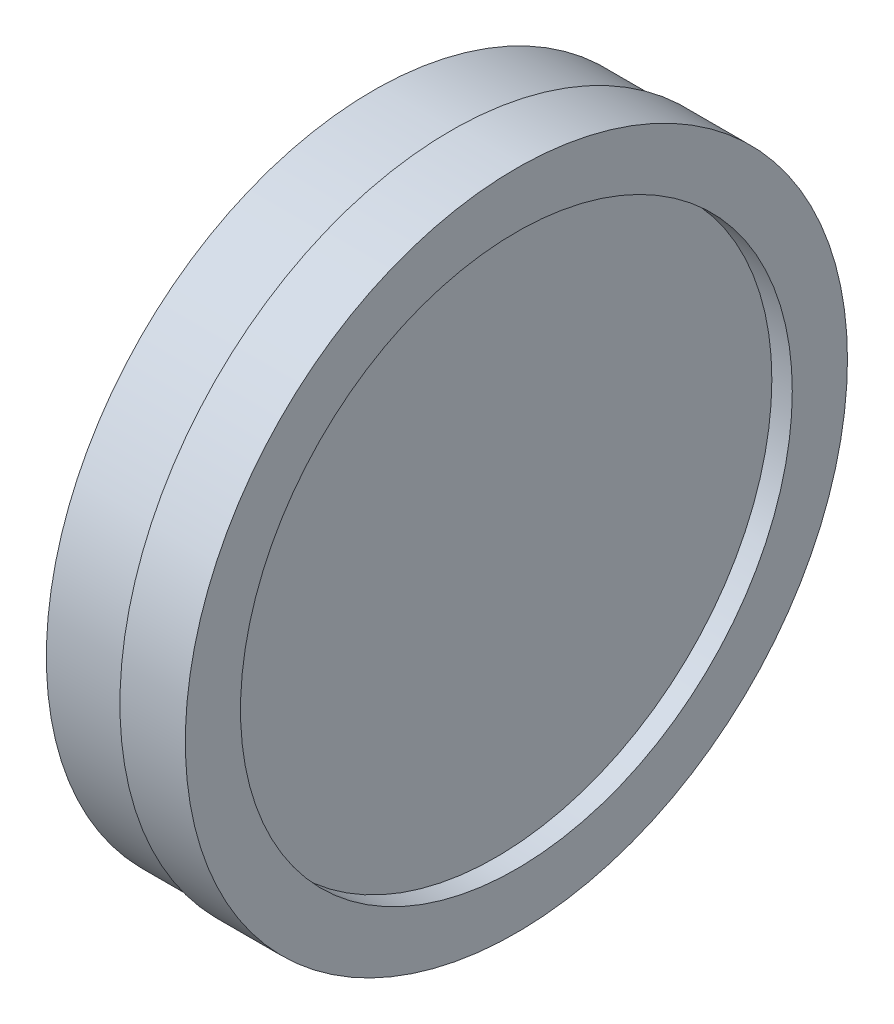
ISO-10303-21;
HEADER;
FILE_DESCRIPTION(('STEP AP214'),'2;1');
FILE_NAME('part.step','',(''),(''),'','','');
FILE_SCHEMA(('AUTOMOTIVE_DESIGN { 1 0 10303 214 1 1 1 1 }'));
ENDSEC;
DATA;
#1=APPLICATION_CONTEXT('core data for automotive mechanical design processes');
#2=APPLICATION_PROTOCOL_DEFINITION('international standard','automotive_design',2000,#1);
#3=PRODUCT_CONTEXT('',#1,'mechanical');
#4=PRODUCT('Part','Part','',(#3));
#5=PRODUCT_RELATED_PRODUCT_CATEGORY('part','',(#4));
#6=PRODUCT_DEFINITION_FORMATION('','',#4);
#7=PRODUCT_DEFINITION_CONTEXT('part definition',#1,'design');
#8=PRODUCT_DEFINITION('design','',#6,#7);
#9=PRODUCT_DEFINITION_SHAPE('','',#8);
#10=(LENGTH_UNIT() NAMED_UNIT(*) SI_UNIT(.MILLI.,.METRE.));
#11=(NAMED_UNIT(*) PLANE_ANGLE_UNIT() SI_UNIT($,.RADIAN.));
#12=(NAMED_UNIT(*) SI_UNIT($,.STERADIAN.) SOLID_ANGLE_UNIT());
#13=UNCERTAINTY_MEASURE_WITH_UNIT(LENGTH_MEASURE(1.E-05),#10,'distance_accuracy_value','');
#14=(GEOMETRIC_REPRESENTATION_CONTEXT(3) GLOBAL_UNCERTAINTY_ASSIGNED_CONTEXT((#13)) GLOBAL_UNIT_ASSIGNED_CONTEXT((#10,
#11,#12)) REPRESENTATION_CONTEXT('',''));
#15=CARTESIAN_POINT('',(0.,0.,0.));
#16=DIRECTION('',(0.,0.,1.));
#17=DIRECTION('',(1.,0.,0.));
#18=AXIS2_PLACEMENT_3D('',#15,#16,#17);
#19=CARTESIAN_POINT('',(0.,0.,0.));
#20=DIRECTION('',(1.,0.,0.));
#21=DIRECTION('',(0.,0.,-1.));
#22=AXIS2_PLACEMENT_3D('',#19,#20,#21);
#23=CYLINDRICAL_SURFACE('',#22,67.5);
#24=CARTESIAN_POINT('',(-5.,0.,0.));
#25=DIRECTION('',(1.,0.,0.));
#26=DIRECTION('',(0.,0.,-1.));
#27=AXIS2_PLACEMENT_3D('',#24,#25,#26);
#28=CIRCLE('',#27,67.5);
#29=CARTESIAN_POINT('',(-5.,0.,-67.5));
#30=VERTEX_POINT('',#29);
#31=EDGE_CURVE('E11',#30,#30,#28,.T.);
#32=ORIENTED_EDGE('',*,*,#31,.F.);
#33=EDGE_LOOP('',(#32));
#34=FACE_BOUND('',#33,.T.);
#35=CARTESIAN_POINT('',(0.,0.,0.));
#36=DIRECTION('',(1.,0.,0.));
#37=DIRECTION('',(0.,0.,-1.));
#38=AXIS2_PLACEMENT_3D('',#35,#36,#37);
#39=CIRCLE('',#38,67.5);
#40=CARTESIAN_POINT('',(0.,0.,-67.5));
#41=VERTEX_POINT('',#40);
#42=EDGE_CURVE('E129',#41,#41,#39,.T.);
#43=ORIENTED_EDGE('',*,*,#42,.T.);
#44=EDGE_LOOP('',(#43));
#45=FACE_BOUND('',#44,.T.);
#46=ADVANCED_FACE('F17',(#34,#45),#23,.F.);
#47=CARTESIAN_POINT('',(-26.5,40.,0.));
#48=DIRECTION('',(-1.,0.,0.));
#49=DIRECTION('',(0.,0.,1.));
#50=AXIS2_PLACEMENT_3D('',#47,#48,#49);
#51=PLANE('',#50);
#52=CARTESIAN_POINT('',(-26.5,0.,0.));
#53=DIRECTION('',(1.,0.,0.));
#54=DIRECTION('',(0.,0.,-1.));
#55=AXIS2_PLACEMENT_3D('',#52,#53,#54);
#56=CIRCLE('',#55,40.);
#57=CARTESIAN_POINT('',(-26.5,0.,-40.));
#58=VERTEX_POINT('',#57);
#59=EDGE_CURVE('E24',#58,#58,#56,.T.);
#60=ORIENTED_EDGE('',*,*,#59,.F.);
#61=EDGE_LOOP('',(#60));
#62=FACE_BOUND('',#61,.T.);
#63=ADVANCED_FACE('F152',(#62),#51,.T.);
#64=CARTESIAN_POINT('',(0.,0.,0.));
#65=DIRECTION('',(1.,0.,0.));
#66=DIRECTION('',(0.,0.,-1.));
#67=AXIS2_PLACEMENT_3D('',#64,#65,#66);
#68=CYLINDRICAL_SURFACE('',#67,40.);
#69=ORIENTED_EDGE('',*,*,#59,.T.);
#70=EDGE_LOOP('',(#69));
#71=FACE_BOUND('',#70,.T.);
#72=CARTESIAN_POINT('',(-35.,0.,0.));
#73=DIRECTION('',(1.,0.,0.));
#74=DIRECTION('',(0.,0.,-1.));
#75=AXIS2_PLACEMENT_3D('',#72,#73,#74);
#76=CIRCLE('',#75,40.);
#77=CARTESIAN_POINT('',(-35.,0.,-40.));
#78=VERTEX_POINT('',#77);
#79=EDGE_CURVE('E144',#78,#78,#76,.T.);
#80=ORIENTED_EDGE('',*,*,#79,.F.);
#81=EDGE_LOOP('',(#80));
#82=FACE_BOUND('',#81,.T.);
#83=ADVANCED_FACE('F149',(#71,#82),#68,.F.);
#84=CARTESIAN_POINT('',(-35.,80.,0.));
#85=DIRECTION('',(-1.,0.,0.));
#86=DIRECTION('',(0.,0.,1.));
#87=AXIS2_PLACEMENT_3D('',#84,#85,#86);
#88=PLANE('',#87);
#89=CARTESIAN_POINT('',(-35.,54.1265877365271,-31.2500000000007));
#90=DIRECTION('',(-1.,0.,0.));
#91=DIRECTION('',(0.,0.,1.));
#92=AXIS2_PLACEMENT_3D('',#89,#90,#91);
#93=CIRCLE('',#92,5.);
#94=CARTESIAN_POINT('',(-35.,54.1265877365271,-26.2500000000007));
#95=VERTEX_POINT('',#94);
#96=EDGE_CURVE('E212',#95,#95,#93,.T.);
#97=ORIENTED_EDGE('',*,*,#96,.F.);
#98=EDGE_LOOP('',(#97));
#99=FACE_BOUND('',#98,.T.);
#100=CARTESIAN_POINT('',(-35.,54.1265877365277,31.2499999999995));
#101=DIRECTION('',(-1.,0.,0.));
#102=DIRECTION('',(0.,0.,1.));
#103=AXIS2_PLACEMENT_3D('',#100,#101,#102);
#104=CIRCLE('',#103,5.);
#105=CARTESIAN_POINT('',(-35.,54.1265877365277,36.2499999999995));
#106=VERTEX_POINT('',#105);
#107=EDGE_CURVE('E56',#106,#106,#104,.T.);
#108=ORIENTED_EDGE('',*,*,#107,.F.);
#109=EDGE_LOOP('',(#108));
#110=FACE_BOUND('',#109,.T.);
#111=CARTESIAN_POINT('',(-35.,4.36435420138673E-13,62.5));
#112=DIRECTION('',(-1.,0.,0.));
#113=DIRECTION('',(0.,0.,1.));
#114=AXIS2_PLACEMENT_3D('',#111,#112,#113);
#115=CIRCLE('',#114,5.);
#116=CARTESIAN_POINT('',(-35.,4.36435420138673E-13,67.5));
#117=VERTEX_POINT('',#116);
#118=EDGE_CURVE('E75',#117,#117,#115,.T.);
#119=ORIENTED_EDGE('',*,*,#118,.F.);
#120=EDGE_LOOP('',(#119));
#121=FACE_BOUND('',#120,.T.);
#122=CARTESIAN_POINT('',(-35.,-54.1265877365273,31.25));
#123=DIRECTION('',(-1.,0.,0.));
#124=DIRECTION('',(0.,0.,1.));
#125=AXIS2_PLACEMENT_3D('',#122,#123,#124);
#126=CIRCLE('',#125,5.);
#127=CARTESIAN_POINT('',(-35.,-54.1265877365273,36.25));
#128=VERTEX_POINT('',#127);
#129=EDGE_CURVE('E87',#128,#128,#126,.T.);
#130=ORIENTED_EDGE('',*,*,#129,.F.);
#131=EDGE_LOOP('',(#130));
#132=FACE_BOUND('',#131,.T.);
#133=CARTESIAN_POINT('',(-35.,-54.1265877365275,-31.25));
#134=DIRECTION('',(-1.,0.,0.));
#135=DIRECTION('',(0.,0.,1.));
#136=AXIS2_PLACEMENT_3D('',#133,#134,#135);
#137=CIRCLE('',#136,5.);
#138=CARTESIAN_POINT('',(-35.,-54.1265877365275,-26.25));
#139=VERTEX_POINT('',#138);
#140=EDGE_CURVE('E99',#139,#139,#137,.T.);
#141=ORIENTED_EDGE('',*,*,#140,.F.);
#142=EDGE_LOOP('',(#141));
#143=FACE_BOUND('',#142,.T.);
#144=CARTESIAN_POINT('',(-35.,0.,-62.5));
#145=DIRECTION('',(-1.,0.,0.));
#146=DIRECTION('',(0.,0.,1.));
#147=AXIS2_PLACEMENT_3D('',#144,#145,#146);
#148=CIRCLE('',#147,5.);
#149=CARTESIAN_POINT('',(-35.,0.,-57.5));
#150=VERTEX_POINT('',#149);
#151=EDGE_CURVE('E111',#150,#150,#148,.T.);
#152=ORIENTED_EDGE('',*,*,#151,.F.);
#153=EDGE_LOOP('',(#152));
#154=FACE_BOUND('',#153,.T.);
#155=CARTESIAN_POINT('',(-35.,62.5,0.));
#156=DIRECTION('',(-1.,0.,0.));
#157=DIRECTION('',(0.,0.,1.));
#158=AXIS2_PLACEMENT_3D('',#155,#156,#157);
#159=CIRCLE('',#158,5.);
#160=CARTESIAN_POINT('',(-35.,62.5,5.));
#161=VERTEX_POINT('',#160);
#162=EDGE_CURVE('E123',#161,#161,#159,.T.);
#163=ORIENTED_EDGE('',*,*,#162,.F.);
#164=EDGE_LOOP('',(#163));
#165=FACE_BOUND('',#164,.T.);
#166=ORIENTED_EDGE('',*,*,#79,.T.);
#167=EDGE_LOOP('',(#166));
#168=FACE_BOUND('',#167,.T.);
#169=CARTESIAN_POINT('',(-35.,0.,0.));
#170=DIRECTION('',(1.,0.,0.));
#171=DIRECTION('',(0.,0.,-1.));
#172=AXIS2_PLACEMENT_3D('',#169,#170,#171);
#173=CIRCLE('',#172,80.);
#174=CARTESIAN_POINT('',(-35.,0.,-80.));
#175=VERTEX_POINT('',#174);
#176=EDGE_CURVE('E141',#175,#175,#173,.T.);
#177=ORIENTED_EDGE('',*,*,#176,.F.);
#178=EDGE_LOOP('',(#177));
#179=FACE_BOUND('',#178,.T.);
#180=ADVANCED_FACE('F161',(#99,#110,#121,#132,#143,#154,#165,#168,#179),#88,.T.);
#181=CARTESIAN_POINT('',(0.,0.,0.));
#182=DIRECTION('',(1.,0.,0.));
#183=DIRECTION('',(0.,0.,-1.));
#184=AXIS2_PLACEMENT_3D('',#181,#182,#183);
#185=CYLINDRICAL_SURFACE('',#184,80.);
#186=ORIENTED_EDGE('',*,*,#176,.T.);
#187=EDGE_LOOP('',(#186));
#188=FACE_BOUND('',#187,.T.);
#189=CARTESIAN_POINT('',(-16.,0.,0.));
#190=DIRECTION('',(1.,0.,0.));
#191=DIRECTION('',(0.,0.,-1.));
#192=AXIS2_PLACEMENT_3D('',#189,#190,#191);
#193=CIRCLE('',#192,80.);
#194=CARTESIAN_POINT('',(-16.,0.,-80.));
#195=VERTEX_POINT('',#194);
#196=EDGE_CURVE('E138',#195,#195,#193,.T.);
#197=ORIENTED_EDGE('',*,*,#196,.F.);
#198=EDGE_LOOP('',(#197));
#199=FACE_BOUND('',#198,.T.);
#200=ADVANCED_FACE('F200',(#188,#199),#185,.T.);
#201=CARTESIAN_POINT('',(-16.,81.,0.));
#202=DIRECTION('',(-1.,0.,0.));
#203=DIRECTION('',(0.,0.,1.));
#204=AXIS2_PLACEMENT_3D('',#201,#202,#203);
#205=PLANE('',#204);
#206=ORIENTED_EDGE('',*,*,#196,.T.);
#207=EDGE_LOOP('',(#206));
#208=FACE_BOUND('',#207,.T.);
#209=CARTESIAN_POINT('',(-16.,0.,0.));
#210=DIRECTION('',(1.,0.,0.));
#211=DIRECTION('',(0.,0.,-1.));
#212=AXIS2_PLACEMENT_3D('',#209,#210,#211);
#213=CIRCLE('',#212,81.);
#214=CARTESIAN_POINT('',(-16.,0.,-81.));
#215=VERTEX_POINT('',#214);
#216=EDGE_CURVE('E135',#215,#215,#213,.T.);
#217=ORIENTED_EDGE('',*,*,#216,.F.);
#218=EDGE_LOOP('',(#217));
#219=FACE_BOUND('',#218,.T.);
#220=ADVANCED_FACE('F193',(#208,#219),#205,.T.);
#221=CARTESIAN_POINT('',(0.,0.,0.));
#222=DIRECTION('',(1.,0.,0.));
#223=DIRECTION('',(0.,0.,-1.));
#224=AXIS2_PLACEMENT_3D('',#221,#222,#223);
#225=CYLINDRICAL_SURFACE('',#224,81.);
#226=ORIENTED_EDGE('',*,*,#216,.T.);
#227=EDGE_LOOP('',(#226));
#228=FACE_BOUND('',#227,.T.);
#229=CARTESIAN_POINT('',(0.,0.,0.));
#230=DIRECTION('',(1.,0.,0.));
#231=DIRECTION('',(0.,0.,-1.));
#232=AXIS2_PLACEMENT_3D('',#229,#230,#231);
#233=CIRCLE('',#232,81.);
#234=CARTESIAN_POINT('',(0.,0.,-81.));
#235=VERTEX_POINT('',#234);
#236=EDGE_CURVE('E132',#235,#235,#233,.T.);
#237=ORIENTED_EDGE('',*,*,#236,.F.);
#238=EDGE_LOOP('',(#237));
#239=FACE_BOUND('',#238,.T.);
#240=ADVANCED_FACE('F183',(#228,#239),#225,.T.);
#241=CARTESIAN_POINT('',(0.,67.5,0.));
#242=DIRECTION('',(1.,0.,0.));
#243=DIRECTION('',(0.,0.,-1.));
#244=AXIS2_PLACEMENT_3D('',#241,#242,#243);
#245=PLANE('',#244);
#246=ORIENTED_EDGE('',*,*,#236,.T.);
#247=EDGE_LOOP('',(#246));
#248=FACE_BOUND('',#247,.T.);
#249=ORIENTED_EDGE('',*,*,#42,.F.);
#250=EDGE_LOOP('',(#249));
#251=FACE_BOUND('',#250,.T.);
#252=ADVANCED_FACE('F180',(#248,#251),#245,.T.);
#253=CARTESIAN_POINT('',(-20.,62.5,0.));
#254=DIRECTION('',(-1.,0.,0.));
#255=DIRECTION('',(0.,0.,1.));
#256=AXIS2_PLACEMENT_3D('',#253,#254,#255);
#257=CONICAL_SURFACE('',#256,5.,1.02974425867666);
#258=CARTESIAN_POINT('',(-16.9956969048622,62.5,0.));
#259=VERTEX_POINT('',#258);
#260=VERTEX_LOOP('',#259);
#261=FACE_BOUND('',#260,.T.);
#262=CARTESIAN_POINT('',(-20.,62.5,0.));
#263=DIRECTION('',(-1.,0.,0.));
#264=DIRECTION('',(0.,0.,1.));
#265=AXIS2_PLACEMENT_3D('',#262,#263,#264);
#266=CIRCLE('',#265,5.);
#267=CARTESIAN_POINT('',(-20.,62.5,5.));
#268=VERTEX_POINT('',#267);
#269=EDGE_CURVE('E126',#268,#268,#266,.T.);
#270=ORIENTED_EDGE('',*,*,#269,.T.);
#271=EDGE_LOOP('',(#270));
#272=FACE_BOUND('',#271,.T.);
#273=ADVANCED_FACE('F182',(#261,#272),#257,.F.);
#274=CARTESIAN_POINT('',(-35.,62.5,0.));
#275=DIRECTION('',(-1.,0.,0.));
#276=DIRECTION('',(0.,0.,1.));
#277=AXIS2_PLACEMENT_3D('',#274,#275,#276);
#278=CYLINDRICAL_SURFACE('',#277,5.);
#279=ORIENTED_EDGE('',*,*,#269,.F.);
#280=EDGE_LOOP('',(#279));
#281=FACE_BOUND('',#280,.T.);
#282=ORIENTED_EDGE('',*,*,#162,.T.);
#283=EDGE_LOOP('',(#282));
#284=FACE_BOUND('',#283,.T.);
#285=ADVANCED_FACE('F191',(#281,#284),#278,.F.);
#286=CARTESIAN_POINT('',(-14.,0.,-62.5));
#287=DIRECTION('',(-1.,0.,0.));
#288=DIRECTION('',(0.,0.,1.));
#289=AXIS2_PLACEMENT_3D('',#286,#287,#288);
#290=CONICAL_SURFACE('',#289,4.25,1.02974425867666);
#291=CARTESIAN_POINT('',(-11.4463423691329,0.,-62.5));
#292=VERTEX_POINT('',#291);
#293=VERTEX_LOOP('',#292);
#294=FACE_BOUND('',#293,.T.);
#295=CARTESIAN_POINT('',(-14.,0.,-62.5));
#296=DIRECTION('',(-1.,0.,0.));
#297=DIRECTION('',(0.,0.,1.));
#298=AXIS2_PLACEMENT_3D('',#295,#296,#297);
#299=CIRCLE('',#298,4.25);
#300=CARTESIAN_POINT('',(-14.,0.,-58.25));
#301=VERTEX_POINT('',#300);
#302=EDGE_CURVE('E120',#301,#301,#299,.T.);
#303=ORIENTED_EDGE('',*,*,#302,.T.);
#304=EDGE_LOOP('',(#303));
#305=FACE_BOUND('',#304,.T.);
#306=ADVANCED_FACE('F236',(#294,#305),#290,.F.);
#307=CARTESIAN_POINT('',(-35.,0.,-62.5));
#308=DIRECTION('',(-1.,0.,0.));
#309=DIRECTION('',(0.,0.,1.));
#310=AXIS2_PLACEMENT_3D('',#307,#308,#309);
#311=CYLINDRICAL_SURFACE('',#310,4.25);
#312=ORIENTED_EDGE('',*,*,#302,.F.);
#313=EDGE_LOOP('',(#312));
#314=FACE_BOUND('',#313,.T.);
#315=CARTESIAN_POINT('',(-14.2009618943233,0.,-62.5));
#316=DIRECTION('',(-1.,0.,0.));
#317=DIRECTION('',(0.,0.,1.));
#318=AXIS2_PLACEMENT_3D('',#315,#316,#317);
#319=CIRCLE('',#318,4.25);
#320=CARTESIAN_POINT('',(-14.2009618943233,0.,-58.25));
#321=VERTEX_POINT('',#320);
#322=EDGE_CURVE('E117',#321,#321,#319,.T.);
#323=ORIENTED_EDGE('',*,*,#322,.T.);
#324=EDGE_LOOP('',(#323));
#325=FACE_BOUND('',#324,.T.);
#326=ADVANCED_FACE('F242',(#314,#325),#311,.F.);
#327=CARTESIAN_POINT('',(-17.,0.,-62.5));
#328=DIRECTION('',(-1.,0.,0.));
#329=DIRECTION('',(0.,0.,1.));
#330=AXIS2_PLACEMENT_3D('',#327,#328,#329);
#331=CONICAL_SURFACE('',#330,5.,0.261799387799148);
#332=ORIENTED_EDGE('',*,*,#322,.F.);
#333=EDGE_LOOP('',(#332));
#334=FACE_BOUND('',#333,.T.);
#335=CARTESIAN_POINT('',(-17.,0.,-62.5));
#336=DIRECTION('',(-1.,0.,0.));
#337=DIRECTION('',(0.,0.,1.));
#338=AXIS2_PLACEMENT_3D('',#335,#336,#337);
#339=CIRCLE('',#338,5.);
#340=CARTESIAN_POINT('',(-17.,0.,-57.5));
#341=VERTEX_POINT('',#340);
#342=EDGE_CURVE('E114',#341,#341,#339,.T.);
#343=ORIENTED_EDGE('',*,*,#342,.T.);
#344=EDGE_LOOP('',(#343));
#345=FACE_BOUND('',#344,.T.);
#346=ADVANCED_FACE('F248',(#334,#345),#331,.F.);
#347=CARTESIAN_POINT('',(-35.,0.,-62.5));
#348=DIRECTION('',(-1.,0.,0.));
#349=DIRECTION('',(0.,0.,1.));
#350=AXIS2_PLACEMENT_3D('',#347,#348,#349);
#351=CYLINDRICAL_SURFACE('',#350,5.);
#352=ORIENTED_EDGE('',*,*,#342,.F.);
#353=EDGE_LOOP('',(#352));
#354=FACE_BOUND('',#353,.T.);
#355=ORIENTED_EDGE('',*,*,#151,.T.);
#356=EDGE_LOOP('',(#355));
#357=FACE_BOUND('',#356,.T.);
#358=ADVANCED_FACE('F252',(#354,#357),#351,.F.);
#359=CARTESIAN_POINT('',(-14.,-54.1265877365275,-31.25));
#360=DIRECTION('',(-1.,0.,0.));
#361=DIRECTION('',(0.,0.,1.));
#362=AXIS2_PLACEMENT_3D('',#359,#360,#361);
#363=CONICAL_SURFACE('',#362,4.25,1.02974425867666);
#364=CARTESIAN_POINT('',(-11.4463423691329,-54.1265877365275,-31.25));
#365=VERTEX_POINT('',#364);
#366=VERTEX_LOOP('',#365);
#367=FACE_BOUND('',#366,.T.);
#368=CARTESIAN_POINT('',(-14.,-54.1265877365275,-31.25));
#369=DIRECTION('',(-1.,0.,0.));
#370=DIRECTION('',(0.,0.,1.));
#371=AXIS2_PLACEMENT_3D('',#368,#369,#370);
#372=CIRCLE('',#371,4.25);
#373=CARTESIAN_POINT('',(-14.,-54.1265877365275,-27.));
#374=VERTEX_POINT('',#373);
#375=EDGE_CURVE('E108',#374,#374,#372,.T.);
#376=ORIENTED_EDGE('',*,*,#375,.T.);
#377=EDGE_LOOP('',(#376));
#378=FACE_BOUND('',#377,.T.);
#379=ADVANCED_FACE('F256',(#367,#378),#363,.F.);
#380=CARTESIAN_POINT('',(-35.,-54.1265877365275,-31.25));
#381=DIRECTION('',(-1.,0.,0.));
#382=DIRECTION('',(0.,0.,1.));
#383=AXIS2_PLACEMENT_3D('',#380,#381,#382);
#384=CYLINDRICAL_SURFACE('',#383,4.25);
#385=ORIENTED_EDGE('',*,*,#375,.F.);
#386=EDGE_LOOP('',(#385));
#387=FACE_BOUND('',#386,.T.);
#388=CARTESIAN_POINT('',(-14.2009618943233,-54.1265877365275,-31.25));
#389=DIRECTION('',(-1.,0.,0.));
#390=DIRECTION('',(0.,0.,1.));
#391=AXIS2_PLACEMENT_3D('',#388,#389,#390);
#392=CIRCLE('',#391,4.25);
#393=CARTESIAN_POINT('',(-14.2009618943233,-54.1265877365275,-27.));
#394=VERTEX_POINT('',#393);
#395=EDGE_CURVE('E105',#394,#394,#392,.T.);
#396=ORIENTED_EDGE('',*,*,#395,.T.);
#397=EDGE_LOOP('',(#396));
#398=FACE_BOUND('',#397,.T.);
#399=ADVANCED_FACE('F260',(#387,#398),#384,.F.);
#400=CARTESIAN_POINT('',(-17.,-54.1265877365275,-31.25));
#401=DIRECTION('',(-1.,0.,0.));
#402=DIRECTION('',(0.,0.,1.));
#403=AXIS2_PLACEMENT_3D('',#400,#401,#402);
#404=CONICAL_SURFACE('',#403,5.,0.261799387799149);
#405=ORIENTED_EDGE('',*,*,#395,.F.);
#406=EDGE_LOOP('',(#405));
#407=FACE_BOUND('',#406,.T.);
#408=CARTESIAN_POINT('',(-17.,-54.1265877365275,-31.25));
#409=DIRECTION('',(-1.,0.,0.));
#410=DIRECTION('',(0.,0.,1.));
#411=AXIS2_PLACEMENT_3D('',#408,#409,#410);
#412=CIRCLE('',#411,5.);
#413=CARTESIAN_POINT('',(-17.,-54.1265877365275,-26.25));
#414=VERTEX_POINT('',#413);
#415=EDGE_CURVE('E102',#414,#414,#412,.T.);
#416=ORIENTED_EDGE('',*,*,#415,.T.);
#417=EDGE_LOOP('',(#416));
#418=FACE_BOUND('',#417,.T.);
#419=ADVANCED_FACE('F264',(#407,#418),#404,.F.);
#420=CARTESIAN_POINT('',(-35.,-54.1265877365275,-31.25));
#421=DIRECTION('',(-1.,0.,0.));
#422=DIRECTION('',(0.,0.,1.));
#423=AXIS2_PLACEMENT_3D('',#420,#421,#422);
#424=CYLINDRICAL_SURFACE('',#423,5.);
#425=ORIENTED_EDGE('',*,*,#415,.F.);
#426=EDGE_LOOP('',(#425));
#427=FACE_BOUND('',#426,.T.);
#428=ORIENTED_EDGE('',*,*,#140,.T.);
#429=EDGE_LOOP('',(#428));
#430=FACE_BOUND('',#429,.T.);
#431=ADVANCED_FACE('F268',(#427,#430),#424,.F.);
#432=CARTESIAN_POINT('',(-14.,-54.1265877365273,31.25));
#433=DIRECTION('',(-1.,0.,0.));
#434=DIRECTION('',(0.,0.,1.));
#435=AXIS2_PLACEMENT_3D('',#432,#433,#434);
#436=CONICAL_SURFACE('',#435,4.25,1.02974425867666);
#437=CARTESIAN_POINT('',(-11.4463423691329,-54.1265877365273,31.25));
#438=VERTEX_POINT('',#437);
#439=VERTEX_LOOP('',#438);
#440=FACE_BOUND('',#439,.T.);
#441=CARTESIAN_POINT('',(-14.,-54.1265877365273,31.25));
#442=DIRECTION('',(-1.,0.,0.));
#443=DIRECTION('',(0.,0.,1.));
#444=AXIS2_PLACEMENT_3D('',#441,#442,#443);
#445=CIRCLE('',#444,4.25);
#446=CARTESIAN_POINT('',(-14.,-54.1265877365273,35.5));
#447=VERTEX_POINT('',#446);
#448=EDGE_CURVE('E96',#447,#447,#445,.T.);
#449=ORIENTED_EDGE('',*,*,#448,.T.);
#450=EDGE_LOOP('',(#449));
#451=FACE_BOUND('',#450,.T.);
#452=ADVANCED_FACE('F272',(#440,#451),#436,.F.);
#453=CARTESIAN_POINT('',(-35.,-54.1265877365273,31.25));
#454=DIRECTION('',(-1.,0.,0.));
#455=DIRECTION('',(0.,0.,1.));
#456=AXIS2_PLACEMENT_3D('',#453,#454,#455);
#457=CYLINDRICAL_SURFACE('',#456,4.25);
#458=ORIENTED_EDGE('',*,*,#448,.F.);
#459=EDGE_LOOP('',(#458));
#460=FACE_BOUND('',#459,.T.);
#461=CARTESIAN_POINT('',(-14.2009618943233,-54.1265877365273,31.25));
#462=DIRECTION('',(-1.,0.,0.));
#463=DIRECTION('',(0.,0.,1.));
#464=AXIS2_PLACEMENT_3D('',#461,#462,#463);
#465=CIRCLE('',#464,4.25);
#466=CARTESIAN_POINT('',(-14.2009618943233,-54.1265877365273,35.5));
#467=VERTEX_POINT('',#466);
#468=EDGE_CURVE('E93',#467,#467,#465,.T.);
#469=ORIENTED_EDGE('',*,*,#468,.T.);
#470=EDGE_LOOP('',(#469));
#471=FACE_BOUND('',#470,.T.);
#472=ADVANCED_FACE('F276',(#460,#471),#457,.F.);
#473=CARTESIAN_POINT('',(-17.,-54.1265877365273,31.25));
#474=DIRECTION('',(-1.,0.,0.));
#475=DIRECTION('',(0.,0.,1.));
#476=AXIS2_PLACEMENT_3D('',#473,#474,#475);
#477=CONICAL_SURFACE('',#476,5.,0.261799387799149);
#478=ORIENTED_EDGE('',*,*,#468,.F.);
#479=EDGE_LOOP('',(#478));
#480=FACE_BOUND('',#479,.T.);
#481=CARTESIAN_POINT('',(-17.,-54.1265877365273,31.25));
#482=DIRECTION('',(-1.,0.,0.));
#483=DIRECTION('',(0.,0.,1.));
#484=AXIS2_PLACEMENT_3D('',#481,#482,#483);
#485=CIRCLE('',#484,5.);
#486=CARTESIAN_POINT('',(-17.,-54.1265877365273,36.25));
#487=VERTEX_POINT('',#486);
#488=EDGE_CURVE('E90',#487,#487,#485,.T.);
#489=ORIENTED_EDGE('',*,*,#488,.T.);
#490=EDGE_LOOP('',(#489));
#491=FACE_BOUND('',#490,.T.);
#492=ADVANCED_FACE('F280',(#480,#491),#477,.F.);
#493=CARTESIAN_POINT('',(-35.,-54.1265877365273,31.25));
#494=DIRECTION('',(-1.,0.,0.));
#495=DIRECTION('',(0.,0.,1.));
#496=AXIS2_PLACEMENT_3D('',#493,#494,#495);
#497=CYLINDRICAL_SURFACE('',#496,5.);
#498=ORIENTED_EDGE('',*,*,#488,.F.);
#499=EDGE_LOOP('',(#498));
#500=FACE_BOUND('',#499,.T.);
#501=ORIENTED_EDGE('',*,*,#129,.T.);
#502=EDGE_LOOP('',(#501));
#503=FACE_BOUND('',#502,.T.);
#504=ADVANCED_FACE('F284',(#500,#503),#497,.F.);
#505=CARTESIAN_POINT('',(-14.,4.36435420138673E-13,62.5));
#506=DIRECTION('',(-1.,0.,0.));
#507=DIRECTION('',(0.,0.,1.));
#508=AXIS2_PLACEMENT_3D('',#505,#506,#507);
#509=CONICAL_SURFACE('',#508,4.25,1.02974425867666);
#510=CARTESIAN_POINT('',(-11.4463423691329,4.36435420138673E-13,62.5));
#511=VERTEX_POINT('',#510);
#512=VERTEX_LOOP('',#511);
#513=FACE_BOUND('',#512,.T.);
#514=CARTESIAN_POINT('',(-14.,4.36435420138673E-13,62.5));
#515=DIRECTION('',(-1.,0.,0.));
#516=DIRECTION('',(0.,0.,1.));
#517=AXIS2_PLACEMENT_3D('',#514,#515,#516);
#518=CIRCLE('',#517,4.25);
#519=CARTESIAN_POINT('',(-14.,4.36435420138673E-13,66.75));
#520=VERTEX_POINT('',#519);
#521=EDGE_CURVE('E84',#520,#520,#518,.T.);
#522=ORIENTED_EDGE('',*,*,#521,.T.);
#523=EDGE_LOOP('',(#522));
#524=FACE_BOUND('',#523,.T.);
#525=ADVANCED_FACE('F288',(#513,#524),#509,.F.);
#526=CARTESIAN_POINT('',(-35.,4.36435420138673E-13,62.5));
#527=DIRECTION('',(-1.,0.,0.));
#528=DIRECTION('',(0.,0.,1.));
#529=AXIS2_PLACEMENT_3D('',#526,#527,#528);
#530=CYLINDRICAL_SURFACE('',#529,4.25);
#531=ORIENTED_EDGE('',*,*,#521,.F.);
#532=EDGE_LOOP('',(#531));
#533=FACE_BOUND('',#532,.T.);
#534=CARTESIAN_POINT('',(-14.2009618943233,4.36435420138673E-13,62.5));
#535=DIRECTION('',(-1.,0.,0.));
#536=DIRECTION('',(0.,0.,1.));
#537=AXIS2_PLACEMENT_3D('',#534,#535,#536);
#538=CIRCLE('',#537,4.25);
#539=CARTESIAN_POINT('',(-14.2009618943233,4.36435420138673E-13,66.75));
#540=VERTEX_POINT('',#539);
#541=EDGE_CURVE('E81',#540,#540,#538,.T.);
#542=ORIENTED_EDGE('',*,*,#541,.T.);
#543=EDGE_LOOP('',(#542));
#544=FACE_BOUND('',#543,.T.);
#545=ADVANCED_FACE('F292',(#533,#544),#530,.F.);
#546=CARTESIAN_POINT('',(-17.,4.36435420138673E-13,62.5));
#547=DIRECTION('',(-1.,0.,0.));
#548=DIRECTION('',(0.,0.,1.));
#549=AXIS2_PLACEMENT_3D('',#546,#547,#548);
#550=CONICAL_SURFACE('',#549,5.,0.261799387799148);
#551=ORIENTED_EDGE('',*,*,#541,.F.);
#552=EDGE_LOOP('',(#551));
#553=FACE_BOUND('',#552,.T.);
#554=CARTESIAN_POINT('',(-17.,4.36435420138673E-13,62.5));
#555=DIRECTION('',(-1.,0.,0.));
#556=DIRECTION('',(0.,0.,1.));
#557=AXIS2_PLACEMENT_3D('',#554,#555,#556);
#558=CIRCLE('',#557,5.);
#559=CARTESIAN_POINT('',(-17.,4.36435420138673E-13,67.5));
#560=VERTEX_POINT('',#559);
#561=EDGE_CURVE('E78',#560,#560,#558,.T.);
#562=ORIENTED_EDGE('',*,*,#561,.T.);
#563=EDGE_LOOP('',(#562));
#564=FACE_BOUND('',#563,.T.);
#565=ADVANCED_FACE('F296',(#553,#564),#550,.F.);
#566=CARTESIAN_POINT('',(-35.,4.36435420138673E-13,62.5));
#567=DIRECTION('',(-1.,0.,0.));
#568=DIRECTION('',(0.,0.,1.));
#569=AXIS2_PLACEMENT_3D('',#566,#567,#568);
#570=CYLINDRICAL_SURFACE('',#569,5.);
#571=ORIENTED_EDGE('',*,*,#561,.F.);
#572=EDGE_LOOP('',(#571));
#573=FACE_BOUND('',#572,.T.);
#574=ORIENTED_EDGE('',*,*,#118,.T.);
#575=EDGE_LOOP('',(#574));
#576=FACE_BOUND('',#575,.T.);
#577=ADVANCED_FACE('F300',(#573,#576),#570,.F.);
#578=CARTESIAN_POINT('',(-14.,54.1265877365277,31.2499999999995));
#579=DIRECTION('',(-1.,0.,0.));
#580=DIRECTION('',(0.,0.,1.));
#581=AXIS2_PLACEMENT_3D('',#578,#579,#580);
#582=CONICAL_SURFACE('',#581,4.25,1.02974425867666);
#583=CARTESIAN_POINT('',(-11.4463423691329,54.1265877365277,31.2499999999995));
#584=VERTEX_POINT('',#583);
#585=VERTEX_LOOP('',#584);
#586=FACE_BOUND('',#585,.T.);
#587=CARTESIAN_POINT('',(-14.,54.1265877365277,31.2499999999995));
#588=DIRECTION('',(-1.,0.,0.));
#589=DIRECTION('',(0.,0.,1.));
#590=AXIS2_PLACEMENT_3D('',#587,#588,#589);
#591=CIRCLE('',#590,4.25);
#592=CARTESIAN_POINT('',(-14.,54.1265877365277,35.4999999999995));
#593=VERTEX_POINT('',#592);
#594=EDGE_CURVE('E72',#593,#593,#591,.T.);
#595=ORIENTED_EDGE('',*,*,#594,.T.);
#596=EDGE_LOOP('',(#595));
#597=FACE_BOUND('',#596,.T.);
#598=ADVANCED_FACE('F304',(#586,#597),#582,.F.);
#599=CARTESIAN_POINT('',(-35.,54.1265877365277,31.2499999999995));
#600=DIRECTION('',(-1.,0.,0.));
#601=DIRECTION('',(0.,0.,1.));
#602=AXIS2_PLACEMENT_3D('',#599,#600,#601);
#603=CYLINDRICAL_SURFACE('',#602,4.25);
#604=ORIENTED_EDGE('',*,*,#594,.F.);
#605=EDGE_LOOP('',(#604));
#606=FACE_BOUND('',#605,.T.);
#607=CARTESIAN_POINT('',(-14.2009618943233,54.1265877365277,31.2499999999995));
#608=DIRECTION('',(-1.,0.,0.));
#609=DIRECTION('',(0.,0.,1.));
#610=AXIS2_PLACEMENT_3D('',#607,#608,#609);
#611=CIRCLE('',#610,4.25);
#612=CARTESIAN_POINT('',(-14.2009618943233,54.1265877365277,35.4999999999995));
#613=VERTEX_POINT('',#612);
#614=EDGE_CURVE('E69',#613,#613,#611,.T.);
#615=ORIENTED_EDGE('',*,*,#614,.T.);
#616=EDGE_LOOP('',(#615));
#617=FACE_BOUND('',#616,.T.);
#618=ADVANCED_FACE('F308',(#606,#617),#603,.F.);
#619=CARTESIAN_POINT('',(-17.,54.1265877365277,31.2499999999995));
#620=DIRECTION('',(-1.,0.,0.));
#621=DIRECTION('',(0.,0.,1.));
#622=AXIS2_PLACEMENT_3D('',#619,#620,#621);
#623=CONICAL_SURFACE('',#622,5.,0.261799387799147);
#624=ORIENTED_EDGE('',*,*,#614,.F.);
#625=EDGE_LOOP('',(#624));
#626=FACE_BOUND('',#625,.T.);
#627=CARTESIAN_POINT('',(-17.,54.1265877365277,31.2499999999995));
#628=DIRECTION('',(-1.,0.,0.));
#629=DIRECTION('',(0.,0.,1.));
#630=AXIS2_PLACEMENT_3D('',#627,#628,#629);
#631=CIRCLE('',#630,5.);
#632=CARTESIAN_POINT('',(-17.,54.1265877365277,36.2499999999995));
#633=VERTEX_POINT('',#632);
#634=EDGE_CURVE('E60',#633,#633,#631,.T.);
#635=ORIENTED_EDGE('',*,*,#634,.T.);
#636=EDGE_LOOP('',(#635));
#637=FACE_BOUND('',#636,.T.);
#638=ADVANCED_FACE('F312',(#626,#637),#623,.F.);
#639=CARTESIAN_POINT('',(-35.,54.1265877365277,31.2499999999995));
#640=DIRECTION('',(-1.,0.,0.));
#641=DIRECTION('',(0.,0.,1.));
#642=AXIS2_PLACEMENT_3D('',#639,#640,#641);
#643=CYLINDRICAL_SURFACE('',#642,5.);
#644=ORIENTED_EDGE('',*,*,#634,.F.);
#645=EDGE_LOOP('',(#644));
#646=FACE_BOUND('',#645,.T.);
#647=ORIENTED_EDGE('',*,*,#107,.T.);
#648=EDGE_LOOP('',(#647));
#649=FACE_BOUND('',#648,.T.);
#650=ADVANCED_FACE('F50',(#646,#649),#643,.F.);
#651=CARTESIAN_POINT('',(-14.,54.1265877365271,-31.2500000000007));
#652=DIRECTION('',(-1.,0.,0.));
#653=DIRECTION('',(0.,0.,1.));
#654=AXIS2_PLACEMENT_3D('',#651,#652,#653);
#655=CONICAL_SURFACE('',#654,4.25,1.02974425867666);
#656=CARTESIAN_POINT('',(-11.4463423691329,54.1265877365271,-31.2500000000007));
#657=VERTEX_POINT('',#656);
#658=VERTEX_LOOP('',#657);
#659=FACE_BOUND('',#658,.T.);
#660=CARTESIAN_POINT('',(-14.,54.1265877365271,-31.2500000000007));
#661=DIRECTION('',(-1.,0.,0.));
#662=DIRECTION('',(0.,0.,1.));
#663=AXIS2_PLACEMENT_3D('',#660,#661,#662);
#664=CIRCLE('',#663,4.25);
#665=CARTESIAN_POINT('',(-14.,54.1265877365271,-27.0000000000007));
#666=VERTEX_POINT('',#665);
#667=EDGE_CURVE('E54',#666,#666,#664,.T.);
#668=ORIENTED_EDGE('',*,*,#667,.T.);
#669=EDGE_LOOP('',(#668));
#670=FACE_BOUND('',#669,.T.);
#671=ADVANCED_FACE('F46',(#659,#670),#655,.F.);
#672=CARTESIAN_POINT('',(-35.,54.1265877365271,-31.2500000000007));
#673=DIRECTION('',(-1.,0.,0.));
#674=DIRECTION('',(0.,0.,1.));
#675=AXIS2_PLACEMENT_3D('',#672,#673,#674);
#676=CYLINDRICAL_SURFACE('',#675,4.25);
#677=ORIENTED_EDGE('',*,*,#667,.F.);
#678=EDGE_LOOP('',(#677));
#679=FACE_BOUND('',#678,.T.);
#680=CARTESIAN_POINT('',(-14.2009618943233,54.1265877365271,-31.2500000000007));
#681=DIRECTION('',(-1.,0.,0.));
#682=DIRECTION('',(0.,0.,1.));
#683=AXIS2_PLACEMENT_3D('',#680,#681,#682);
#684=CIRCLE('',#683,4.25);
#685=CARTESIAN_POINT('',(-14.2009618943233,54.1265877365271,-27.0000000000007));
#686=VERTEX_POINT('',#685);
#687=EDGE_CURVE('E57',#686,#686,#684,.T.);
#688=ORIENTED_EDGE('',*,*,#687,.T.);
#689=EDGE_LOOP('',(#688));
#690=FACE_BOUND('',#689,.T.);
#691=ADVANCED_FACE('F49',(#679,#690),#676,.F.);
#692=CARTESIAN_POINT('',(-17.,54.1265877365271,-31.2500000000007));
#693=DIRECTION('',(-1.,0.,0.));
#694=DIRECTION('',(0.,0.,1.));
#695=AXIS2_PLACEMENT_3D('',#692,#693,#694);
#696=CONICAL_SURFACE('',#695,5.,0.261799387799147);
#697=ORIENTED_EDGE('',*,*,#687,.F.);
#698=EDGE_LOOP('',(#697));
#699=FACE_BOUND('',#698,.T.);
#700=CARTESIAN_POINT('',(-17.,54.1265877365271,-31.2500000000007));
#701=DIRECTION('',(-1.,0.,0.));
#702=DIRECTION('',(0.,0.,1.));
#703=AXIS2_PLACEMENT_3D('',#700,#701,#702);
#704=CIRCLE('',#703,5.);
#705=CARTESIAN_POINT('',(-17.,54.1265877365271,-26.2500000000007));
#706=VERTEX_POINT('',#705);
#707=EDGE_CURVE('E63',#706,#706,#704,.T.);
#708=ORIENTED_EDGE('',*,*,#707,.T.);
#709=EDGE_LOOP('',(#708));
#710=FACE_BOUND('',#709,.T.);
#711=ADVANCED_FACE('F173',(#699,#710),#696,.F.);
#712=CARTESIAN_POINT('',(-35.,54.1265877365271,-31.2500000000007));
#713=DIRECTION('',(-1.,0.,0.));
#714=DIRECTION('',(0.,0.,1.));
#715=AXIS2_PLACEMENT_3D('',#712,#713,#714);
#716=CYLINDRICAL_SURFACE('',#715,5.);
#717=ORIENTED_EDGE('',*,*,#707,.F.);
#718=EDGE_LOOP('',(#717));
#719=FACE_BOUND('',#718,.T.);
#720=ORIENTED_EDGE('',*,*,#96,.T.);
#721=EDGE_LOOP('',(#720));
#722=FACE_BOUND('',#721,.T.);
#723=ADVANCED_FACE('F167',(#719,#722),#716,.F.);
#724=CARTESIAN_POINT('',(-5.,0.,0.));
#725=DIRECTION('',(1.,0.,0.));
#726=DIRECTION('',(0.,0.,-1.));
#727=AXIS2_PLACEMENT_3D('',#724,#725,#726);
#728=PLANE('',#727);
#729=ORIENTED_EDGE('',*,*,#31,.T.);
#730=EDGE_LOOP('',(#729));
#731=FACE_BOUND('',#730,.T.);
#732=ADVANCED_FACE('F165',(#731),#728,.T.);
#733=CLOSED_SHELL('',(#46,#63,#83,#180,#200,#220,#240,#252,#273,#285,#306,#326,#346,#358,#379,
#399,#419,#431,#452,#472,#492,#504,#525,#545,#565,#577,#598,#618,#638,#650,#671,#691,#711,#723,#732));
#734=MANIFOLD_SOLID_BREP('B1',#733);
#735=ADVANCED_BREP_SHAPE_REPRESENTATION('',(#18,#734),#14);
#736=SHAPE_DEFINITION_REPRESENTATION(#9,#735);
ENDSEC;
END-ISO-10303-21;
